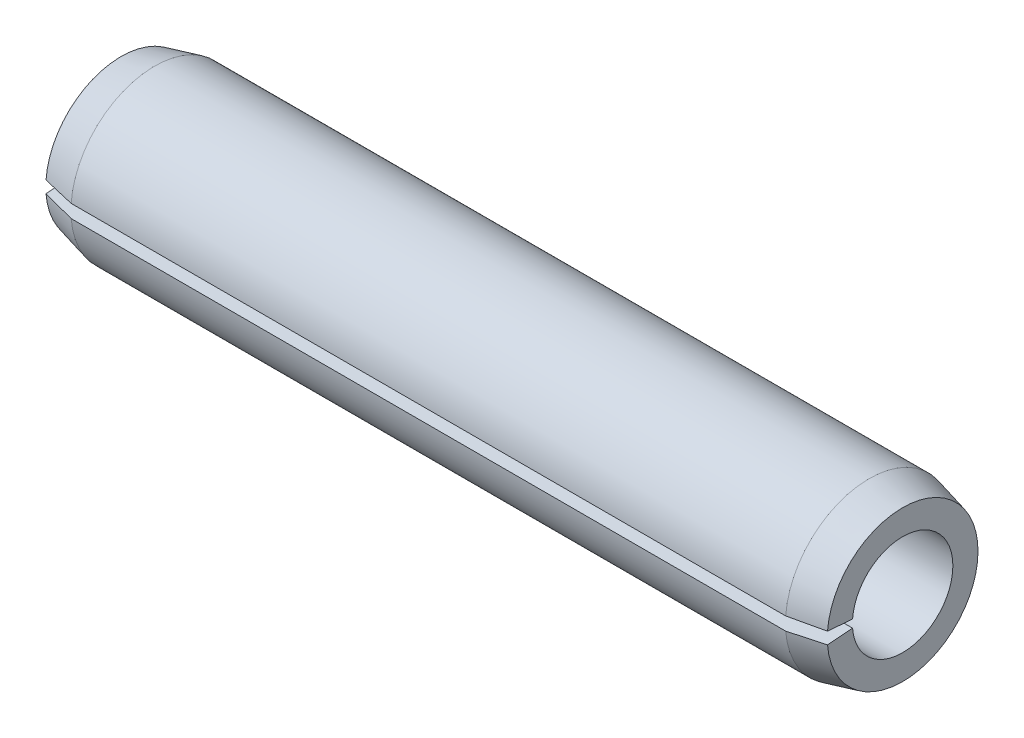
from build123d import *

# Parameters (mm, degrees)
GAP_DEPTH = 29.319604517


with BuildPart() as part:
    # Sketch1 → Base-Revolve (revolve)
    with BuildSketch(Plane.XY, mode=Mode.PRIVATE) as base_revolve_sk:
        Polygon((0, 1.8), (28, 1.8), (28, 2.7), (26.8, 3), (1.2, 3), (0, 2.7), align=None)
    revolve(base_revolve_sk.sketch.rotate(Axis((-9.525, 0, 0), (1, 0, 0)), 90), axis=Axis((-9.525, 0, 0), (1, 0, 0)))

    # Sketch2 → Gap (cut, through all)
    with BuildSketch(Plane(origin=(0, 0, 0), x_dir=(0, -1, 0), z_dir=(-1, 0, 0))):
        with BuildLine():
            Line((0, 0), (0.240084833, 3.050567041))
            ThreePointArc((0.240084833, 3.050567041), (0, 3.06), (-0.240084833, 3.050567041))
            Line((-0.240084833, 3.050567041), (0, 0))
        make_face()
    extrude(amount=-GAP_DEPTH, mode=Mode.SUBTRACT)


solid = part.part
